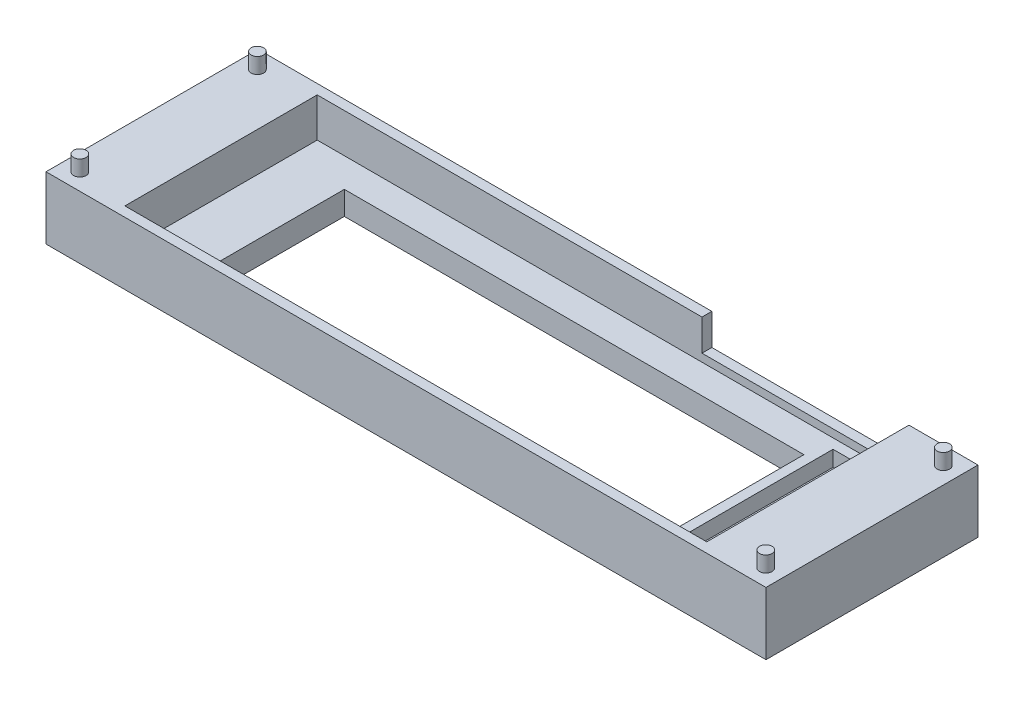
ISO-10303-21;
HEADER;
FILE_DESCRIPTION(('STEP AP214'),'2;1');
FILE_NAME('part.step','',(''),(''),'','','');
FILE_SCHEMA(('AUTOMOTIVE_DESIGN { 1 0 10303 214 1 1 1 1 }'));
ENDSEC;
DATA;
#1=APPLICATION_CONTEXT('core data for automotive mechanical design processes');
#2=APPLICATION_PROTOCOL_DEFINITION('international standard','automotive_design',2000,#1);
#3=PRODUCT_CONTEXT('',#1,'mechanical');
#4=PRODUCT('Part','Part','',(#3));
#5=PRODUCT_RELATED_PRODUCT_CATEGORY('part','',(#4));
#6=PRODUCT_DEFINITION_FORMATION('','',#4);
#7=PRODUCT_DEFINITION_CONTEXT('part definition',#1,'design');
#8=PRODUCT_DEFINITION('design','',#6,#7);
#9=PRODUCT_DEFINITION_SHAPE('','',#8);
#10=(LENGTH_UNIT() NAMED_UNIT(*) SI_UNIT(.MILLI.,.METRE.));
#11=(NAMED_UNIT(*) PLANE_ANGLE_UNIT() SI_UNIT($,.RADIAN.));
#12=(NAMED_UNIT(*) SI_UNIT($,.STERADIAN.) SOLID_ANGLE_UNIT());
#13=UNCERTAINTY_MEASURE_WITH_UNIT(LENGTH_MEASURE(1.E-05),#10,'distance_accuracy_value','');
#14=(GEOMETRIC_REPRESENTATION_CONTEXT(3) GLOBAL_UNCERTAINTY_ASSIGNED_CONTEXT((#13)) GLOBAL_UNIT_ASSIGNED_CONTEXT((#10,
#11,#12)) REPRESENTATION_CONTEXT('',''));
#15=CARTESIAN_POINT('',(0.,0.,0.));
#16=DIRECTION('',(0.,0.,1.));
#17=DIRECTION('',(1.,0.,0.));
#18=AXIS2_PLACEMENT_3D('',#15,#16,#17);
#19=CARTESIAN_POINT('',(0.,6.35,0.));
#20=DIRECTION('',(0.,1.,0.));
#21=DIRECTION('',(0.,0.,1.));
#22=AXIS2_PLACEMENT_3D('',#19,#20,#21);
#23=PLANE('',#22);
#24=CARTESIAN_POINT('',(69.57,6.35,-17.9));
#25=DIRECTION('',(0.,1.,0.));
#26=DIRECTION('',(0.,0.,1.));
#27=AXIS2_PLACEMENT_3D('',#24,#25,#26);
#28=CIRCLE('',#27,1.26999999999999);
#29=CARTESIAN_POINT('',(69.57,6.35,-16.63));
#30=VERTEX_POINT('',#29);
#31=EDGE_CURVE('E267',#30,#30,#28,.T.);
#32=ORIENTED_EDGE('',*,*,#31,.F.);
#33=EDGE_LOOP('',(#32));
#34=FACE_BOUND('',#33,.T.);
#35=CARTESIAN_POINT('',(69.57,6.35,18.1));
#36=DIRECTION('',(0.,1.,0.));
#37=DIRECTION('',(0.,0.,1.));
#38=AXIS2_PLACEMENT_3D('',#35,#36,#37);
#39=CIRCLE('',#38,1.26999999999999);
#40=CARTESIAN_POINT('',(69.57,6.35,19.37));
#41=VERTEX_POINT('',#40);
#42=EDGE_CURVE('E271',#41,#41,#39,.T.);
#43=ORIENTED_EDGE('',*,*,#42,.F.);
#44=EDGE_LOOP('',(#43));
#45=FACE_BOUND('',#44,.T.);
#46=CARTESIAN_POINT('',(-69.53,6.35,18.1));
#47=DIRECTION('',(0.,1.,0.));
#48=DIRECTION('',(0.,0.,1.));
#49=AXIS2_PLACEMENT_3D('',#46,#47,#48);
#50=CIRCLE('',#49,1.26999999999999);
#51=CARTESIAN_POINT('',(-69.53,6.35,19.37));
#52=VERTEX_POINT('',#51);
#53=EDGE_CURVE('E277',#52,#52,#50,.T.);
#54=ORIENTED_EDGE('',*,*,#53,.F.);
#55=EDGE_LOOP('',(#54));
#56=FACE_BOUND('',#55,.T.);
#57=CARTESIAN_POINT('',(-69.53,6.35,-17.9));
#58=DIRECTION('',(0.,1.,0.));
#59=DIRECTION('',(0.,0.,1.));
#60=AXIS2_PLACEMENT_3D('',#57,#58,#59);
#61=CIRCLE('',#60,1.26999999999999);
#62=CARTESIAN_POINT('',(-69.53,6.35,-16.63));
#63=VERTEX_POINT('',#62);
#64=EDGE_CURVE('E283',#63,#63,#61,.T.);
#65=ORIENTED_EDGE('',*,*,#64,.F.);
#66=EDGE_LOOP('',(#65));
#67=FACE_BOUND('',#66,.T.);
#68=DIRECTION('',(-1.,0.,0.));
#69=VECTOR('',#68,1.);
#70=CARTESIAN_POINT('',(-73.,6.35,-21.5));
#71=LINE('',#70,#69);
#72=CARTESIAN_POINT('',(73.,6.35,-21.5));
#73=VERTEX_POINT('',#72);
#74=CARTESIAN_POINT('',(59.,6.35,-21.5));
#75=VERTEX_POINT('',#74);
#76=EDGE_CURVE('E330',#73,#75,#71,.T.);
#77=ORIENTED_EDGE('',*,*,#76,.T.);
#78=DIRECTION('',(0.,0.,-1.));
#79=VECTOR('',#78,1.);
#80=CARTESIAN_POINT('',(59.,6.35,-19.5));
#81=LINE('',#80,#79);
#82=CARTESIAN_POINT('',(59.,6.35,19.5));
#83=VERTEX_POINT('',#82);
#84=EDGE_CURVE('E308',#83,#75,#81,.T.);
#85=ORIENTED_EDGE('',*,*,#84,.F.);
#86=DIRECTION('',(1.,0.,0.));
#87=VECTOR('',#86,1.);
#88=CARTESIAN_POINT('',(-59.,6.35,19.5));
#89=LINE('',#88,#87);
#90=CARTESIAN_POINT('',(-59.,6.35,19.5));
#91=VERTEX_POINT('',#90);
#92=EDGE_CURVE('E306',#91,#83,#89,.T.);
#93=ORIENTED_EDGE('',*,*,#92,.F.);
#94=DIRECTION('',(0.,0.,1.));
#95=VECTOR('',#94,1.);
#96=CARTESIAN_POINT('',(-59.,6.35,-19.5));
#97=LINE('',#96,#95);
#98=CARTESIAN_POINT('',(-59.,6.35,-19.5));
#99=VERTEX_POINT('',#98);
#100=EDGE_CURVE('E304',#99,#91,#97,.T.);
#101=ORIENTED_EDGE('',*,*,#100,.F.);
#102=DIRECTION('',(-1.,0.,0.));
#103=VECTOR('',#102,1.);
#104=CARTESIAN_POINT('',(-59.,6.35,-19.5));
#105=LINE('',#104,#103);
#106=CARTESIAN_POINT('',(19.025,6.35,-19.5));
#107=VERTEX_POINT('',#106);
#108=EDGE_CURVE('E310',#107,#99,#105,.T.);
#109=ORIENTED_EDGE('',*,*,#108,.F.);
#110=DIRECTION('',(0.,0.,1.));
#111=VECTOR('',#110,1.);
#112=CARTESIAN_POINT('',(19.025,6.35,0.));
#113=LINE('',#112,#111);
#114=CARTESIAN_POINT('',(19.025,6.35,-21.5));
#115=VERTEX_POINT('',#114);
#116=EDGE_CURVE('E298',#115,#107,#113,.T.);
#117=ORIENTED_EDGE('',*,*,#116,.F.);
#118=CARTESIAN_POINT('',(-73.,6.35,-21.5));
#119=VERTEX_POINT('',#118);
#120=EDGE_CURVE('E329',#115,#119,#71,.T.);
#121=ORIENTED_EDGE('',*,*,#120,.T.);
#122=DIRECTION('',(0.,0.,1.));
#123=VECTOR('',#122,1.);
#124=CARTESIAN_POINT('',(-73.,6.35,-21.5));
#125=LINE('',#124,#123);
#126=CARTESIAN_POINT('',(-73.,6.35,21.5));
#127=VERTEX_POINT('',#126);
#128=EDGE_CURVE('E322',#119,#127,#125,.T.);
#129=ORIENTED_EDGE('',*,*,#128,.T.);
#130=DIRECTION('',(1.,0.,0.));
#131=VECTOR('',#130,1.);
#132=CARTESIAN_POINT('',(-73.,6.35,21.5));
#133=LINE('',#132,#131);
#134=CARTESIAN_POINT('',(73.,6.35,21.5));
#135=VERTEX_POINT('',#134);
#136=EDGE_CURVE('E325',#127,#135,#133,.T.);
#137=ORIENTED_EDGE('',*,*,#136,.T.);
#138=DIRECTION('',(0.,0.,-1.));
#139=VECTOR('',#138,1.);
#140=CARTESIAN_POINT('',(73.,6.35,-21.5));
#141=LINE('',#140,#139);
#142=EDGE_CURVE('E327',#135,#73,#141,.T.);
#143=ORIENTED_EDGE('',*,*,#142,.T.);
#144=EDGE_LOOP('',(#77,#85,#93,#101,#109,#117,#121,#129,#137,#143));
#145=FACE_BOUND('',#144,.T.);
#146=ADVANCED_FACE('F35',(#34,#45,#56,#67,#145),#23,.T.);
#147=CARTESIAN_POINT('',(-73.,6.35,-21.5));
#148=DIRECTION('',(1.,0.,0.));
#149=DIRECTION('',(0.,0.,-1.));
#150=AXIS2_PLACEMENT_3D('',#147,#148,#149);
#151=PLANE('',#150);
#152=DIRECTION('',(0.,-1.,0.));
#153=VECTOR('',#152,1.);
#154=CARTESIAN_POINT('',(-73.,6.35,-21.5));
#155=LINE('',#154,#153);
#156=CARTESIAN_POINT('',(-73.,-6.35,-21.5));
#157=VERTEX_POINT('',#156);
#158=EDGE_CURVE('E333',#119,#157,#155,.T.);
#159=ORIENTED_EDGE('',*,*,#158,.T.);
#160=DIRECTION('',(0.,0.,-1.));
#161=VECTOR('',#160,1.);
#162=CARTESIAN_POINT('',(-73.,-6.35,-21.5));
#163=LINE('',#162,#161);
#164=CARTESIAN_POINT('',(-73.,-6.35,21.5));
#165=VERTEX_POINT('',#164);
#166=EDGE_CURVE('E235',#165,#157,#163,.T.);
#167=ORIENTED_EDGE('',*,*,#166,.F.);
#168=DIRECTION('',(0.,-1.,0.));
#169=VECTOR('',#168,1.);
#170=CARTESIAN_POINT('',(-73.,6.35,21.5));
#171=LINE('',#170,#169);
#172=EDGE_CURVE('E11',#127,#165,#171,.T.);
#173=ORIENTED_EDGE('',*,*,#172,.F.);
#174=ORIENTED_EDGE('',*,*,#128,.F.);
#175=EDGE_LOOP('',(#159,#167,#173,#174));
#176=FACE_BOUND('',#175,.T.);
#177=ADVANCED_FACE('F37',(#176),#151,.F.);
#178=CARTESIAN_POINT('',(-73.,6.35,21.5));
#179=DIRECTION('',(0.,0.,-1.));
#180=DIRECTION('',(-1.,0.,0.));
#181=AXIS2_PLACEMENT_3D('',#178,#179,#180);
#182=PLANE('',#181);
#183=ORIENTED_EDGE('',*,*,#172,.T.);
#184=DIRECTION('',(-1.,0.,0.));
#185=VECTOR('',#184,1.);
#186=CARTESIAN_POINT('',(-73.,-6.35,21.5));
#187=LINE('',#186,#185);
#188=CARTESIAN_POINT('',(73.,-6.35,21.5));
#189=VERTEX_POINT('',#188);
#190=EDGE_CURVE('E244',#189,#165,#187,.T.);
#191=ORIENTED_EDGE('',*,*,#190,.F.);
#192=DIRECTION('',(0.,-1.,0.));
#193=VECTOR('',#192,1.);
#194=CARTESIAN_POINT('',(73.,6.35,21.5));
#195=LINE('',#194,#193);
#196=EDGE_CURVE('E43',#135,#189,#195,.T.);
#197=ORIENTED_EDGE('',*,*,#196,.F.);
#198=ORIENTED_EDGE('',*,*,#136,.F.);
#199=EDGE_LOOP('',(#183,#191,#197,#198));
#200=FACE_BOUND('',#199,.T.);
#201=ADVANCED_FACE('F349',(#200),#182,.F.);
#202=CARTESIAN_POINT('',(73.,6.35,-21.5));
#203=DIRECTION('',(-1.,0.,0.));
#204=DIRECTION('',(0.,0.,1.));
#205=AXIS2_PLACEMENT_3D('',#202,#203,#204);
#206=PLANE('',#205);
#207=ORIENTED_EDGE('',*,*,#196,.T.);
#208=DIRECTION('',(0.,0.,1.));
#209=VECTOR('',#208,1.);
#210=CARTESIAN_POINT('',(73.,-6.35,-21.5));
#211=LINE('',#210,#209);
#212=CARTESIAN_POINT('',(73.,-6.35,-21.5));
#213=VERTEX_POINT('',#212);
#214=EDGE_CURVE('E241',#213,#189,#211,.T.);
#215=ORIENTED_EDGE('',*,*,#214,.F.);
#216=DIRECTION('',(0.,-1.,0.));
#217=VECTOR('',#216,1.);
#218=CARTESIAN_POINT('',(73.,6.35,-21.5));
#219=LINE('',#218,#217);
#220=EDGE_CURVE('E335',#73,#213,#219,.T.);
#221=ORIENTED_EDGE('',*,*,#220,.F.);
#222=ORIENTED_EDGE('',*,*,#142,.F.);
#223=EDGE_LOOP('',(#207,#215,#221,#222));
#224=FACE_BOUND('',#223,.T.);
#225=ADVANCED_FACE('F340',(#224),#206,.F.);
#226=CARTESIAN_POINT('',(-73.,6.35,-21.5));
#227=DIRECTION('',(0.,0.,1.));
#228=DIRECTION('',(1.,0.,0.));
#229=AXIS2_PLACEMENT_3D('',#226,#227,#228);
#230=PLANE('',#229);
#231=ORIENTED_EDGE('',*,*,#120,.F.);
#232=DIRECTION('',(0.,1.,0.));
#233=VECTOR('',#232,1.);
#234=CARTESIAN_POINT('',(19.025,0.,-21.5));
#235=LINE('',#234,#233);
#236=CARTESIAN_POINT('',(19.025,0.,-21.5));
#237=VERTEX_POINT('',#236);
#238=EDGE_CURVE('E299',#237,#115,#235,.T.);
#239=ORIENTED_EDGE('',*,*,#238,.F.);
#240=DIRECTION('',(1.,0.,0.));
#241=VECTOR('',#240,1.);
#242=CARTESIAN_POINT('',(-73.,0.,-21.5));
#243=LINE('',#242,#241);
#244=CARTESIAN_POINT('',(59.,0.,-21.5));
#245=VERTEX_POINT('',#244);
#246=EDGE_CURVE('E264',#237,#245,#243,.T.);
#247=ORIENTED_EDGE('',*,*,#246,.T.);
#248=DIRECTION('',(0.,1.,0.));
#249=VECTOR('',#248,1.);
#250=CARTESIAN_POINT('',(59.,0.,-21.5));
#251=LINE('',#250,#249);
#252=EDGE_CURVE('E294',#245,#75,#251,.T.);
#253=ORIENTED_EDGE('',*,*,#252,.T.);
#254=ORIENTED_EDGE('',*,*,#76,.F.);
#255=ORIENTED_EDGE('',*,*,#220,.T.);
#256=DIRECTION('',(1.,0.,0.));
#257=VECTOR('',#256,1.);
#258=CARTESIAN_POINT('',(-73.,-6.35,-21.5));
#259=LINE('',#258,#257);
#260=EDGE_CURVE('E238',#157,#213,#259,.T.);
#261=ORIENTED_EDGE('',*,*,#260,.F.);
#262=ORIENTED_EDGE('',*,*,#158,.F.);
#263=EDGE_LOOP('',(#231,#239,#247,#253,#254,#255,#261,#262));
#264=FACE_BOUND('',#263,.T.);
#265=ADVANCED_FACE('F356',(#264),#230,.F.);
#266=CARTESIAN_POINT('',(-59.,6.35,-19.5));
#267=DIRECTION('',(1.,0.,0.));
#268=DIRECTION('',(0.,0.,-1.));
#269=AXIS2_PLACEMENT_3D('',#266,#267,#268);
#270=PLANE('',#269);
#271=DIRECTION('',(0.,-1.,0.));
#272=VECTOR('',#271,1.);
#273=CARTESIAN_POINT('',(-59.,6.35,19.5));
#274=LINE('',#273,#272);
#275=CARTESIAN_POINT('',(-59.,-1.5875,19.5));
#276=VERTEX_POINT('',#275);
#277=EDGE_CURVE('E319',#91,#276,#274,.T.);
#278=ORIENTED_EDGE('',*,*,#277,.T.);
#279=DIRECTION('',(0.,0.,-1.));
#280=VECTOR('',#279,1.);
#281=CARTESIAN_POINT('',(-59.,-1.5875,-19.5));
#282=LINE('',#281,#280);
#283=CARTESIAN_POINT('',(-59.,-1.5875,-19.5));
#284=VERTEX_POINT('',#283);
#285=EDGE_CURVE('E248',#276,#284,#282,.T.);
#286=ORIENTED_EDGE('',*,*,#285,.T.);
#287=DIRECTION('',(0.,-1.,0.));
#288=VECTOR('',#287,1.);
#289=CARTESIAN_POINT('',(-59.,6.35,-19.5));
#290=LINE('',#289,#288);
#291=EDGE_CURVE('E312',#99,#284,#290,.T.);
#292=ORIENTED_EDGE('',*,*,#291,.F.);
#293=ORIENTED_EDGE('',*,*,#100,.T.);
#294=EDGE_LOOP('',(#278,#286,#292,#293));
#295=FACE_BOUND('',#294,.T.);
#296=ADVANCED_FACE('F382',(#295),#270,.T.);
#297=CARTESIAN_POINT('',(-59.,6.35,19.5));
#298=DIRECTION('',(0.,0.,-1.));
#299=DIRECTION('',(-1.,0.,0.));
#300=AXIS2_PLACEMENT_3D('',#297,#298,#299);
#301=PLANE('',#300);
#302=DIRECTION('',(0.,-1.,0.));
#303=VECTOR('',#302,1.);
#304=CARTESIAN_POINT('',(59.,6.35,19.5));
#305=LINE('',#304,#303);
#306=CARTESIAN_POINT('',(59.,-1.5875,19.5));
#307=VERTEX_POINT('',#306);
#308=EDGE_CURVE('E316',#83,#307,#305,.T.);
#309=ORIENTED_EDGE('',*,*,#308,.T.);
#310=DIRECTION('',(-1.,0.,0.));
#311=VECTOR('',#310,1.);
#312=CARTESIAN_POINT('',(-59.,-1.5875,19.5));
#313=LINE('',#312,#311);
#314=EDGE_CURVE('E257',#307,#276,#313,.T.);
#315=ORIENTED_EDGE('',*,*,#314,.T.);
#316=ORIENTED_EDGE('',*,*,#277,.F.);
#317=ORIENTED_EDGE('',*,*,#92,.T.);
#318=EDGE_LOOP('',(#309,#315,#316,#317));
#319=FACE_BOUND('',#318,.T.);
#320=ADVANCED_FACE('F378',(#319),#301,.T.);
#321=CARTESIAN_POINT('',(59.,6.35,-19.5));
#322=DIRECTION('',(-1.,0.,0.));
#323=DIRECTION('',(0.,0.,1.));
#324=AXIS2_PLACEMENT_3D('',#321,#322,#323);
#325=PLANE('',#324);
#326=DIRECTION('',(0.,0.,-1.));
#327=VECTOR('',#326,1.);
#328=CARTESIAN_POINT('',(59.,0.,-19.5));
#329=LINE('',#328,#327);
#330=CARTESIAN_POINT('',(59.,0.,-19.5));
#331=VERTEX_POINT('',#330);
#332=EDGE_CURVE('E58',#331,#245,#329,.T.);
#333=ORIENTED_EDGE('',*,*,#332,.F.);
#334=DIRECTION('',(0.,1.,0.));
#335=VECTOR('',#334,1.);
#336=CARTESIAN_POINT('',(59.,-1.5875,-19.5));
#337=LINE('',#336,#335);
#338=CARTESIAN_POINT('',(59.,-1.5875,-19.5));
#339=VERTEX_POINT('',#338);
#340=EDGE_CURVE('E260',#339,#331,#337,.T.);
#341=ORIENTED_EDGE('',*,*,#340,.F.);
#342=DIRECTION('',(0.,0.,1.));
#343=VECTOR('',#342,1.);
#344=CARTESIAN_POINT('',(59.,-1.5875,-19.5));
#345=LINE('',#344,#343);
#346=EDGE_CURVE('E254',#339,#307,#345,.T.);
#347=ORIENTED_EDGE('',*,*,#346,.T.);
#348=ORIENTED_EDGE('',*,*,#308,.F.);
#349=ORIENTED_EDGE('',*,*,#84,.T.);
#350=ORIENTED_EDGE('',*,*,#252,.F.);
#351=EDGE_LOOP('',(#333,#341,#347,#348,#349,#350));
#352=FACE_BOUND('',#351,.T.);
#353=ADVANCED_FACE('F371',(#352),#325,.T.);
#354=CARTESIAN_POINT('',(-59.,6.35,-19.5));
#355=DIRECTION('',(0.,0.,1.));
#356=DIRECTION('',(1.,0.,0.));
#357=AXIS2_PLACEMENT_3D('',#354,#355,#356);
#358=PLANE('',#357);
#359=DIRECTION('',(0.,1.,0.));
#360=VECTOR('',#359,1.);
#361=CARTESIAN_POINT('',(19.025,0.,-19.5));
#362=LINE('',#361,#360);
#363=CARTESIAN_POINT('',(19.025,0.,-19.5));
#364=VERTEX_POINT('',#363);
#365=EDGE_CURVE('E295',#364,#107,#362,.T.);
#366=ORIENTED_EDGE('',*,*,#365,.T.);
#367=ORIENTED_EDGE('',*,*,#108,.T.);
#368=ORIENTED_EDGE('',*,*,#291,.T.);
#369=DIRECTION('',(1.,0.,0.));
#370=VECTOR('',#369,1.);
#371=CARTESIAN_POINT('',(-59.,-1.5875,-19.5));
#372=LINE('',#371,#370);
#373=EDGE_CURVE('E251',#284,#339,#372,.T.);
#374=ORIENTED_EDGE('',*,*,#373,.T.);
#375=ORIENTED_EDGE('',*,*,#340,.T.);
#376=DIRECTION('',(1.,0.,0.));
#377=VECTOR('',#376,1.);
#378=CARTESIAN_POINT('',(-59.,0.,-19.5));
#379=LINE('',#378,#377);
#380=EDGE_CURVE('E247',#364,#331,#379,.T.);
#381=ORIENTED_EDGE('',*,*,#380,.F.);
#382=EDGE_LOOP('',(#366,#367,#368,#374,#375,#381));
#383=FACE_BOUND('',#382,.T.);
#384=ADVANCED_FACE('F370',(#383),#358,.T.);
#385=CARTESIAN_POINT('',(19.025,0.,-21.5));
#386=DIRECTION('',(-1.,0.,0.));
#387=DIRECTION('',(0.,0.,1.));
#388=AXIS2_PLACEMENT_3D('',#385,#386,#387);
#389=PLANE('',#388);
#390=ORIENTED_EDGE('',*,*,#116,.T.);
#391=ORIENTED_EDGE('',*,*,#365,.F.);
#392=DIRECTION('',(0.,0.,1.));
#393=VECTOR('',#392,1.);
#394=CARTESIAN_POINT('',(19.025,0.,-21.5));
#395=LINE('',#394,#393);
#396=EDGE_CURVE('E289',#237,#364,#395,.T.);
#397=ORIENTED_EDGE('',*,*,#396,.F.);
#398=ORIENTED_EDGE('',*,*,#238,.T.);
#399=EDGE_LOOP('',(#390,#391,#397,#398));
#400=FACE_BOUND('',#399,.T.);
#401=ADVANCED_FACE('F383',(#400),#389,.F.);
#402=CARTESIAN_POINT('',(-69.53,9.525,-17.9));
#403=DIRECTION('',(0.,-1.,0.));
#404=DIRECTION('',(0.,0.,-1.));
#405=AXIS2_PLACEMENT_3D('',#402,#403,#404);
#406=CYLINDRICAL_SURFACE('',#405,1.26999999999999);
#407=CARTESIAN_POINT('',(-69.53,9.525,-17.9));
#408=DIRECTION('',(0.,1.,0.));
#409=DIRECTION('',(0.,0.,1.));
#410=AXIS2_PLACEMENT_3D('',#407,#408,#409);
#411=CIRCLE('',#410,1.26999999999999);
#412=CARTESIAN_POINT('',(-69.53,9.525,-16.63));
#413=VERTEX_POINT('',#412);
#414=EDGE_CURVE('E286',#413,#413,#411,.T.);
#415=ORIENTED_EDGE('',*,*,#414,.F.);
#416=EDGE_LOOP('',(#415));
#417=FACE_BOUND('',#416,.T.);
#418=ORIENTED_EDGE('',*,*,#64,.T.);
#419=EDGE_LOOP('',(#418));
#420=FACE_BOUND('',#419,.T.);
#421=ADVANCED_FACE('F385',(#417,#420),#406,.T.);
#422=CARTESIAN_POINT('',(-69.53,9.525,-17.9));
#423=DIRECTION('',(0.,1.,0.));
#424=DIRECTION('',(0.,0.,1.));
#425=AXIS2_PLACEMENT_3D('',#422,#423,#424);
#426=PLANE('',#425);
#427=ORIENTED_EDGE('',*,*,#414,.T.);
#428=EDGE_LOOP('',(#427));
#429=FACE_BOUND('',#428,.T.);
#430=ADVANCED_FACE('F391',(#429),#426,.T.);
#431=CARTESIAN_POINT('',(-69.53,9.525,18.1));
#432=DIRECTION('',(0.,-1.,0.));
#433=DIRECTION('',(0.,0.,-1.));
#434=AXIS2_PLACEMENT_3D('',#431,#432,#433);
#435=CYLINDRICAL_SURFACE('',#434,1.26999999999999);
#436=CARTESIAN_POINT('',(-69.53,9.525,18.1));
#437=DIRECTION('',(0.,1.,0.));
#438=DIRECTION('',(0.,0.,1.));
#439=AXIS2_PLACEMENT_3D('',#436,#437,#438);
#440=CIRCLE('',#439,1.26999999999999);
#441=CARTESIAN_POINT('',(-69.53,9.525,19.37));
#442=VERTEX_POINT('',#441);
#443=EDGE_CURVE('E280',#442,#442,#440,.T.);
#444=ORIENTED_EDGE('',*,*,#443,.F.);
#445=EDGE_LOOP('',(#444));
#446=FACE_BOUND('',#445,.T.);
#447=ORIENTED_EDGE('',*,*,#53,.T.);
#448=EDGE_LOOP('',(#447));
#449=FACE_BOUND('',#448,.T.);
#450=ADVANCED_FACE('F571',(#446,#449),#435,.T.);
#451=CARTESIAN_POINT('',(-69.53,9.525,18.1));
#452=DIRECTION('',(0.,1.,0.));
#453=DIRECTION('',(0.,0.,1.));
#454=AXIS2_PLACEMENT_3D('',#451,#452,#453);
#455=PLANE('',#454);
#456=ORIENTED_EDGE('',*,*,#443,.T.);
#457=EDGE_LOOP('',(#456));
#458=FACE_BOUND('',#457,.T.);
#459=ADVANCED_FACE('F567',(#458),#455,.T.);
#460=CARTESIAN_POINT('',(69.57,9.525,18.1));
#461=DIRECTION('',(0.,-1.,0.));
#462=DIRECTION('',(0.,0.,-1.));
#463=AXIS2_PLACEMENT_3D('',#460,#461,#462);
#464=CYLINDRICAL_SURFACE('',#463,1.26999999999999);
#465=CARTESIAN_POINT('',(69.57,9.525,18.1));
#466=DIRECTION('',(0.,1.,0.));
#467=DIRECTION('',(0.,0.,1.));
#468=AXIS2_PLACEMENT_3D('',#465,#466,#467);
#469=CIRCLE('',#468,1.26999999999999);
#470=CARTESIAN_POINT('',(69.57,9.525,19.37));
#471=VERTEX_POINT('',#470);
#472=EDGE_CURVE('E274',#471,#471,#469,.T.);
#473=ORIENTED_EDGE('',*,*,#472,.F.);
#474=EDGE_LOOP('',(#473));
#475=FACE_BOUND('',#474,.T.);
#476=ORIENTED_EDGE('',*,*,#42,.T.);
#477=EDGE_LOOP('',(#476));
#478=FACE_BOUND('',#477,.T.);
#479=ADVANCED_FACE('F563',(#475,#478),#464,.T.);
#480=CARTESIAN_POINT('',(69.57,9.525,18.1));
#481=DIRECTION('',(0.,1.,0.));
#482=DIRECTION('',(0.,0.,1.));
#483=AXIS2_PLACEMENT_3D('',#480,#481,#482);
#484=PLANE('',#483);
#485=ORIENTED_EDGE('',*,*,#472,.T.);
#486=EDGE_LOOP('',(#485));
#487=FACE_BOUND('',#486,.T.);
#488=ADVANCED_FACE('F559',(#487),#484,.T.);
#489=CARTESIAN_POINT('',(69.57,9.525,-17.9));
#490=DIRECTION('',(0.,-1.,0.));
#491=DIRECTION('',(0.,0.,-1.));
#492=AXIS2_PLACEMENT_3D('',#489,#490,#491);
#493=CYLINDRICAL_SURFACE('',#492,1.26999999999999);
#494=CARTESIAN_POINT('',(69.57,9.525,-17.9));
#495=DIRECTION('',(0.,1.,0.));
#496=DIRECTION('',(0.,0.,1.));
#497=AXIS2_PLACEMENT_3D('',#494,#495,#496);
#498=CIRCLE('',#497,1.26999999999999);
#499=CARTESIAN_POINT('',(69.57,9.525,-16.63));
#500=VERTEX_POINT('',#499);
#501=EDGE_CURVE('E268',#500,#500,#498,.T.);
#502=ORIENTED_EDGE('',*,*,#501,.F.);
#503=EDGE_LOOP('',(#502));
#504=FACE_BOUND('',#503,.T.);
#505=ORIENTED_EDGE('',*,*,#31,.T.);
#506=EDGE_LOOP('',(#505));
#507=FACE_BOUND('',#506,.T.);
#508=ADVANCED_FACE('F555',(#504,#507),#493,.T.);
#509=CARTESIAN_POINT('',(69.57,9.525,-17.9));
#510=DIRECTION('',(0.,1.,0.));
#511=DIRECTION('',(0.,0.,1.));
#512=AXIS2_PLACEMENT_3D('',#509,#510,#511);
#513=PLANE('',#512);
#514=ORIENTED_EDGE('',*,*,#501,.T.);
#515=EDGE_LOOP('',(#514));
#516=FACE_BOUND('',#515,.T.);
#517=ADVANCED_FACE('F552',(#516),#513,.T.);
#518=CARTESIAN_POINT('',(0.,0.,0.));
#519=DIRECTION('',(0.,1.,0.));
#520=DIRECTION('',(0.,0.,1.));
#521=AXIS2_PLACEMENT_3D('',#518,#519,#520);
#522=PLANE('',#521);
#523=ORIENTED_EDGE('',*,*,#380,.T.);
#524=ORIENTED_EDGE('',*,*,#332,.T.);
#525=ORIENTED_EDGE('',*,*,#246,.F.);
#526=ORIENTED_EDGE('',*,*,#396,.T.);
#527=EDGE_LOOP('',(#523,#524,#525,#526));
#528=FACE_BOUND('',#527,.T.);
#529=ADVANCED_FACE('F367',(#528),#522,.T.);
#530=CARTESIAN_POINT('',(0.,-6.35,0.));
#531=DIRECTION('',(0.,1.,0.));
#532=DIRECTION('',(0.,0.,1.));
#533=AXIS2_PLACEMENT_3D('',#530,#531,#532);
#534=PLANE('',#533);
#535=ORIENTED_EDGE('',*,*,#166,.T.);
#536=ORIENTED_EDGE('',*,*,#260,.T.);
#537=ORIENTED_EDGE('',*,*,#214,.T.);
#538=ORIENTED_EDGE('',*,*,#190,.T.);
#539=EDGE_LOOP('',(#535,#536,#537,#538));
#540=FACE_BOUND('',#539,.T.);
#541=DIRECTION('',(0.,0.,-1.));
#542=VECTOR('',#541,1.);
#543=CARTESIAN_POINT('',(-47.6,-6.35,-13.6));
#544=LINE('',#543,#542);
#545=CARTESIAN_POINT('',(-47.6,-6.35,14.4));
#546=VERTEX_POINT('',#545);
#547=CARTESIAN_POINT('',(-47.6,-6.35,-13.6));
#548=VERTEX_POINT('',#547);
#549=EDGE_CURVE('E205',#546,#548,#544,.T.);
#550=ORIENTED_EDGE('',*,*,#549,.F.);
#551=DIRECTION('',(-1.,0.,0.));
#552=VECTOR('',#551,1.);
#553=CARTESIAN_POINT('',(-47.6,-6.35,14.4));
#554=LINE('',#553,#552);
#555=CARTESIAN_POINT('',(45.6,-6.35,14.4));
#556=VERTEX_POINT('',#555);
#557=EDGE_CURVE('E213',#556,#546,#554,.T.);
#558=ORIENTED_EDGE('',*,*,#557,.F.);
#559=DIRECTION('',(0.,0.,1.));
#560=VECTOR('',#559,1.);
#561=CARTESIAN_POINT('',(45.6,-6.35,-13.6));
#562=LINE('',#561,#560);
#563=CARTESIAN_POINT('',(45.6,-6.35,-13.6));
#564=VERTEX_POINT('',#563);
#565=EDGE_CURVE('E210',#564,#556,#562,.T.);
#566=ORIENTED_EDGE('',*,*,#565,.F.);
#567=DIRECTION('',(1.,0.,0.));
#568=VECTOR('',#567,1.);
#569=CARTESIAN_POINT('',(-47.6,-6.35,-13.6));
#570=LINE('',#569,#568);
#571=EDGE_CURVE('E207',#548,#564,#570,.T.);
#572=ORIENTED_EDGE('',*,*,#571,.F.);
#573=EDGE_LOOP('',(#550,#558,#566,#572));
#574=FACE_BOUND('',#573,.T.);
#575=ADVANCED_FACE('F345',(#540,#574),#534,.F.);
#576=CARTESIAN_POINT('',(0.,-1.5875,0.));
#577=DIRECTION('',(0.,1.,0.));
#578=DIRECTION('',(0.,0.,1.));
#579=AXIS2_PLACEMENT_3D('',#576,#577,#578);
#580=PLANE('',#579);
#581=DIRECTION('',(0.,0.,1.));
#582=VECTOR('',#581,1.);
#583=CARTESIAN_POINT('',(47.6,-1.5875,-17.5));
#584=LINE('',#583,#582);
#585=CARTESIAN_POINT('',(47.6,-1.5875,-17.5));
#586=VERTEX_POINT('',#585);
#587=CARTESIAN_POINT('',(47.6,-1.5875,17.5));
#588=VERTEX_POINT('',#587);
#589=EDGE_CURVE('E50',#586,#588,#584,.T.);
#590=ORIENTED_EDGE('',*,*,#589,.F.);
#591=DIRECTION('',(-1.,0.,0.));
#592=VECTOR('',#591,1.);
#593=CARTESIAN_POINT('',(47.6,-1.5875,-17.5));
#594=LINE('',#593,#592);
#595=CARTESIAN_POINT('',(57.,-1.5875,-17.5));
#596=VERTEX_POINT('',#595);
#597=EDGE_CURVE('E186',#596,#586,#594,.T.);
#598=ORIENTED_EDGE('',*,*,#597,.F.);
#599=DIRECTION('',(0.,0.,-1.));
#600=VECTOR('',#599,1.);
#601=CARTESIAN_POINT('',(57.,-1.5875,-17.5));
#602=LINE('',#601,#600);
#603=CARTESIAN_POINT('',(57.,-1.5875,17.5));
#604=VERTEX_POINT('',#603);
#605=EDGE_CURVE('E189',#604,#596,#602,.T.);
#606=ORIENTED_EDGE('',*,*,#605,.F.);
#607=DIRECTION('',(1.,0.,0.));
#608=VECTOR('',#607,1.);
#609=CARTESIAN_POINT('',(47.6,-1.5875,17.5));
#610=LINE('',#609,#608);
#611=EDGE_CURVE('E195',#588,#604,#610,.T.);
#612=ORIENTED_EDGE('',*,*,#611,.F.);
#613=EDGE_LOOP('',(#590,#598,#606,#612));
#614=FACE_BOUND('',#613,.T.);
#615=ORIENTED_EDGE('',*,*,#373,.F.);
#616=ORIENTED_EDGE('',*,*,#285,.F.);
#617=ORIENTED_EDGE('',*,*,#314,.F.);
#618=ORIENTED_EDGE('',*,*,#346,.F.);
#619=EDGE_LOOP('',(#615,#616,#617,#618));
#620=FACE_BOUND('',#619,.T.);
#621=DIRECTION('',(-1.,0.,0.));
#622=VECTOR('',#621,1.);
#623=CARTESIAN_POINT('',(-47.6,-1.5875,14.4));
#624=LINE('',#623,#622);
#625=CARTESIAN_POINT('',(45.6,-1.5875,14.4));
#626=VERTEX_POINT('',#625);
#627=CARTESIAN_POINT('',(-47.6,-1.5875,14.4));
#628=VERTEX_POINT('',#627);
#629=EDGE_CURVE('E208',#626,#628,#624,.T.);
#630=ORIENTED_EDGE('',*,*,#629,.T.);
#631=DIRECTION('',(0.,0.,-1.));
#632=VECTOR('',#631,1.);
#633=CARTESIAN_POINT('',(-47.6,-1.5875,-13.6));
#634=LINE('',#633,#632);
#635=CARTESIAN_POINT('',(-47.6,-1.5875,-13.6));
#636=VERTEX_POINT('',#635);
#637=EDGE_CURVE('E201',#628,#636,#634,.T.);
#638=ORIENTED_EDGE('',*,*,#637,.T.);
#639=DIRECTION('',(1.,0.,0.));
#640=VECTOR('',#639,1.);
#641=CARTESIAN_POINT('',(-47.6,-1.5875,-13.6));
#642=LINE('',#641,#640);
#643=CARTESIAN_POINT('',(45.6,-1.5875,-13.6));
#644=VERTEX_POINT('',#643);
#645=EDGE_CURVE('E218',#636,#644,#642,.T.);
#646=ORIENTED_EDGE('',*,*,#645,.T.);
#647=DIRECTION('',(0.,0.,1.));
#648=VECTOR('',#647,1.);
#649=CARTESIAN_POINT('',(45.6,-1.5875,-13.6));
#650=LINE('',#649,#648);
#651=EDGE_CURVE('E221',#644,#626,#650,.T.);
#652=ORIENTED_EDGE('',*,*,#651,.T.);
#653=EDGE_LOOP('',(#630,#638,#646,#652));
#654=FACE_BOUND('',#653,.T.);
#655=ADVANCED_FACE('F374',(#614,#620,#654),#580,.T.);
#656=CARTESIAN_POINT('',(-47.6,-6.35,-13.6));
#657=DIRECTION('',(1.,0.,0.));
#658=DIRECTION('',(0.,0.,-1.));
#659=AXIS2_PLACEMENT_3D('',#656,#657,#658);
#660=PLANE('',#659);
#661=ORIENTED_EDGE('',*,*,#637,.F.);
#662=DIRECTION('',(0.,1.,0.));
#663=VECTOR('',#662,1.);
#664=CARTESIAN_POINT('',(-47.6,-6.35,14.4));
#665=LINE('',#664,#663);
#666=EDGE_CURVE('E215',#546,#628,#665,.T.);
#667=ORIENTED_EDGE('',*,*,#666,.F.);
#668=ORIENTED_EDGE('',*,*,#549,.T.);
#669=DIRECTION('',(0.,1.,0.));
#670=VECTOR('',#669,1.);
#671=CARTESIAN_POINT('',(-47.6,-6.35,-13.6));
#672=LINE('',#671,#670);
#673=EDGE_CURVE('E232',#548,#636,#672,.T.);
#674=ORIENTED_EDGE('',*,*,#673,.T.);
#675=EDGE_LOOP('',(#661,#667,#668,#674));
#676=FACE_BOUND('',#675,.T.);
#677=ADVANCED_FACE('F460',(#676),#660,.T.);
#678=CARTESIAN_POINT('',(-47.6,-6.35,-13.6));
#679=DIRECTION('',(0.,0.,1.));
#680=DIRECTION('',(1.,0.,0.));
#681=AXIS2_PLACEMENT_3D('',#678,#679,#680);
#682=PLANE('',#681);
#683=ORIENTED_EDGE('',*,*,#645,.F.);
#684=ORIENTED_EDGE('',*,*,#673,.F.);
#685=ORIENTED_EDGE('',*,*,#571,.T.);
#686=DIRECTION('',(0.,1.,0.));
#687=VECTOR('',#686,1.);
#688=CARTESIAN_POINT('',(45.6,-6.35,-13.6));
#689=LINE('',#688,#687);
#690=EDGE_CURVE('E230',#564,#644,#689,.T.);
#691=ORIENTED_EDGE('',*,*,#690,.T.);
#692=EDGE_LOOP('',(#683,#684,#685,#691));
#693=FACE_BOUND('',#692,.T.);
#694=ADVANCED_FACE('F465',(#693),#682,.T.);
#695=CARTESIAN_POINT('',(45.6,-6.35,-13.6));
#696=DIRECTION('',(-1.,0.,0.));
#697=DIRECTION('',(0.,0.,1.));
#698=AXIS2_PLACEMENT_3D('',#695,#696,#697);
#699=PLANE('',#698);
#700=ORIENTED_EDGE('',*,*,#651,.F.);
#701=ORIENTED_EDGE('',*,*,#690,.F.);
#702=ORIENTED_EDGE('',*,*,#565,.T.);
#703=DIRECTION('',(0.,1.,0.));
#704=VECTOR('',#703,1.);
#705=CARTESIAN_POINT('',(45.6,-6.35,14.4));
#706=LINE('',#705,#704);
#707=EDGE_CURVE('E228',#556,#626,#706,.T.);
#708=ORIENTED_EDGE('',*,*,#707,.T.);
#709=EDGE_LOOP('',(#700,#701,#702,#708));
#710=FACE_BOUND('',#709,.T.);
#711=ADVANCED_FACE('F475',(#710),#699,.T.);
#712=CARTESIAN_POINT('',(-47.6,-6.35,14.4));
#713=DIRECTION('',(0.,0.,-1.));
#714=DIRECTION('',(-1.,0.,0.));
#715=AXIS2_PLACEMENT_3D('',#712,#713,#714);
#716=PLANE('',#715);
#717=ORIENTED_EDGE('',*,*,#629,.F.);
#718=ORIENTED_EDGE('',*,*,#707,.F.);
#719=ORIENTED_EDGE('',*,*,#557,.T.);
#720=ORIENTED_EDGE('',*,*,#666,.T.);
#721=EDGE_LOOP('',(#717,#718,#719,#720));
#722=FACE_BOUND('',#721,.T.);
#723=ADVANCED_FACE('F485',(#722),#716,.T.);
#724=CARTESIAN_POINT('',(47.6,-4.7625,-17.5));
#725=DIRECTION('',(-1.,0.,0.));
#726=DIRECTION('',(0.,0.,1.));
#727=AXIS2_PLACEMENT_3D('',#724,#725,#726);
#728=PLANE('',#727);
#729=ORIENTED_EDGE('',*,*,#589,.T.);
#730=DIRECTION('',(0.,1.,0.));
#731=VECTOR('',#730,1.);
#732=CARTESIAN_POINT('',(47.6,-4.7625,17.5));
#733=LINE('',#732,#731);
#734=CARTESIAN_POINT('',(47.6,-4.7625,17.5));
#735=VERTEX_POINT('',#734);
#736=EDGE_CURVE('E164',#735,#588,#733,.T.);
#737=ORIENTED_EDGE('',*,*,#736,.F.);
#738=DIRECTION('',(0.,0.,1.));
#739=VECTOR('',#738,1.);
#740=CARTESIAN_POINT('',(47.6,-4.7625,-17.5));
#741=LINE('',#740,#739);
#742=CARTESIAN_POINT('',(47.6,-4.7625,-17.5));
#743=VERTEX_POINT('',#742);
#744=EDGE_CURVE('E168',#743,#735,#741,.T.);
#745=ORIENTED_EDGE('',*,*,#744,.F.);
#746=DIRECTION('',(0.,1.,0.));
#747=VECTOR('',#746,1.);
#748=CARTESIAN_POINT('',(47.6,-4.7625,-17.5));
#749=LINE('',#748,#747);
#750=EDGE_CURVE('E199',#743,#586,#749,.T.);
#751=ORIENTED_EDGE('',*,*,#750,.T.);
#752=EDGE_LOOP('',(#729,#737,#745,#751));
#753=FACE_BOUND('',#752,.T.);
#754=ADVANCED_FACE('F166',(#753),#728,.F.);
#755=CARTESIAN_POINT('',(47.6,-4.7625,-17.5));
#756=DIRECTION('',(0.,0.,-1.));
#757=DIRECTION('',(-1.,0.,0.));
#758=AXIS2_PLACEMENT_3D('',#755,#756,#757);
#759=PLANE('',#758);
#760=ORIENTED_EDGE('',*,*,#597,.T.);
#761=ORIENTED_EDGE('',*,*,#750,.F.);
#762=DIRECTION('',(-1.,0.,0.));
#763=VECTOR('',#762,1.);
#764=CARTESIAN_POINT('',(47.6,-4.7625,-17.5));
#765=LINE('',#764,#763);
#766=CARTESIAN_POINT('',(57.,-4.7625,-17.5));
#767=VERTEX_POINT('',#766);
#768=EDGE_CURVE('E174',#767,#743,#765,.T.);
#769=ORIENTED_EDGE('',*,*,#768,.F.);
#770=DIRECTION('',(0.,1.,0.));
#771=VECTOR('',#770,1.);
#772=CARTESIAN_POINT('',(57.,-4.7625,-17.5));
#773=LINE('',#772,#771);
#774=EDGE_CURVE('E202',#767,#596,#773,.T.);
#775=ORIENTED_EDGE('',*,*,#774,.T.);
#776=EDGE_LOOP('',(#760,#761,#769,#775));
#777=FACE_BOUND('',#776,.T.);
#778=ADVANCED_FACE('F511',(#777),#759,.F.);
#779=CARTESIAN_POINT('',(57.,-4.7625,-17.5));
#780=DIRECTION('',(1.,0.,0.));
#781=DIRECTION('',(0.,0.,-1.));
#782=AXIS2_PLACEMENT_3D('',#779,#780,#781);
#783=PLANE('',#782);
#784=ORIENTED_EDGE('',*,*,#605,.T.);
#785=ORIENTED_EDGE('',*,*,#774,.F.);
#786=DIRECTION('',(0.,0.,-1.));
#787=VECTOR('',#786,1.);
#788=CARTESIAN_POINT('',(57.,-4.7625,-17.5));
#789=LINE('',#788,#787);
#790=CARTESIAN_POINT('',(57.,-4.7625,17.5));
#791=VERTEX_POINT('',#790);
#792=EDGE_CURVE('E182',#791,#767,#789,.T.);
#793=ORIENTED_EDGE('',*,*,#792,.F.);
#794=DIRECTION('',(0.,1.,0.));
#795=VECTOR('',#794,1.);
#796=CARTESIAN_POINT('',(57.,-4.7625,17.5));
#797=LINE('',#796,#795);
#798=EDGE_CURVE('E173',#791,#604,#797,.T.);
#799=ORIENTED_EDGE('',*,*,#798,.T.);
#800=EDGE_LOOP('',(#784,#785,#793,#799));
#801=FACE_BOUND('',#800,.T.);
#802=ADVANCED_FACE('F520',(#801),#783,.F.);
#803=CARTESIAN_POINT('',(47.6,-4.7625,17.5));
#804=DIRECTION('',(0.,0.,1.));
#805=DIRECTION('',(1.,0.,0.));
#806=AXIS2_PLACEMENT_3D('',#803,#804,#805);
#807=PLANE('',#806);
#808=ORIENTED_EDGE('',*,*,#611,.T.);
#809=ORIENTED_EDGE('',*,*,#798,.F.);
#810=DIRECTION('',(1.,0.,0.));
#811=VECTOR('',#810,1.);
#812=CARTESIAN_POINT('',(47.6,-4.7625,17.5));
#813=LINE('',#812,#811);
#814=EDGE_CURVE('E177',#735,#791,#813,.T.);
#815=ORIENTED_EDGE('',*,*,#814,.F.);
#816=ORIENTED_EDGE('',*,*,#736,.T.);
#817=EDGE_LOOP('',(#808,#809,#815,#816));
#818=FACE_BOUND('',#817,.T.);
#819=ADVANCED_FACE('F178',(#818),#807,.F.);
#820=CARTESIAN_POINT('',(0.,-4.7625,0.));
#821=DIRECTION('',(0.,1.,0.));
#822=DIRECTION('',(0.,0.,1.));
#823=AXIS2_PLACEMENT_3D('',#820,#821,#822);
#824=PLANE('',#823);
#825=ORIENTED_EDGE('',*,*,#744,.T.);
#826=ORIENTED_EDGE('',*,*,#814,.T.);
#827=ORIENTED_EDGE('',*,*,#792,.T.);
#828=ORIENTED_EDGE('',*,*,#768,.T.);
#829=EDGE_LOOP('',(#825,#826,#827,#828));
#830=FACE_BOUND('',#829,.T.);
#831=ADVANCED_FACE('F184',(#830),#824,.T.);
#832=CLOSED_SHELL('',(#146,#177,#201,#225,#265,#296,#320,#353,#384,#401,#421,#430,#450,#459,
#479,#488,#508,#517,#529,#575,#655,#677,#694,#711,#723,#754,#778,#802,#819,#831));
#833=MANIFOLD_SOLID_BREP('B2',#832);
#834=ADVANCED_BREP_SHAPE_REPRESENTATION('',(#18,#833),#14);
#835=SHAPE_DEFINITION_REPRESENTATION(#9,#834);
ENDSEC;
END-ISO-10303-21;
